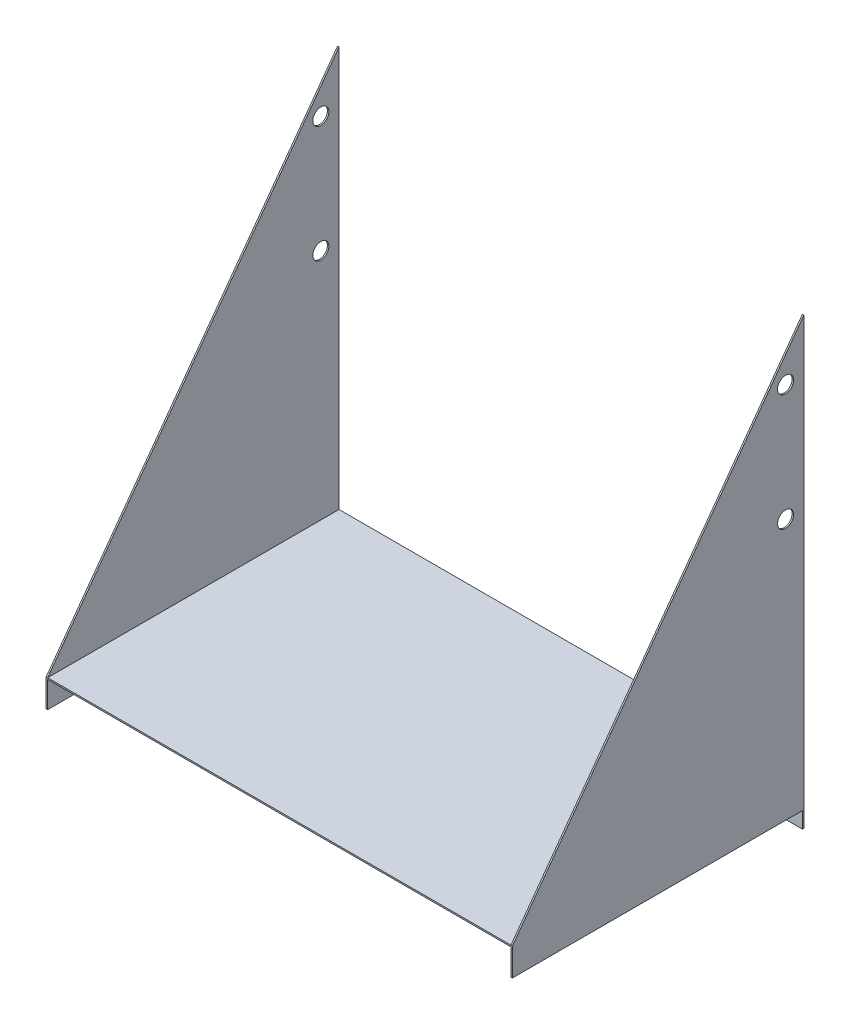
ISO-10303-21;
HEADER;
FILE_DESCRIPTION(('STEP AP214'),'2;1');
FILE_NAME('part.step','',(''),(''),'','','');
FILE_SCHEMA(('AUTOMOTIVE_DESIGN { 1 0 10303 214 1 1 1 1 }'));
ENDSEC;
DATA;
#1=APPLICATION_CONTEXT('core data for automotive mechanical design processes');
#2=APPLICATION_PROTOCOL_DEFINITION('international standard','automotive_design',2000,#1);
#3=PRODUCT_CONTEXT('',#1,'mechanical');
#4=PRODUCT('Part','Part','',(#3));
#5=PRODUCT_RELATED_PRODUCT_CATEGORY('part','',(#4));
#6=PRODUCT_DEFINITION_FORMATION('','',#4);
#7=PRODUCT_DEFINITION_CONTEXT('part definition',#1,'design');
#8=PRODUCT_DEFINITION('design','',#6,#7);
#9=PRODUCT_DEFINITION_SHAPE('','',#8);
#10=(LENGTH_UNIT() NAMED_UNIT(*) SI_UNIT(.MILLI.,.METRE.));
#11=(NAMED_UNIT(*) PLANE_ANGLE_UNIT() SI_UNIT($,.RADIAN.));
#12=(NAMED_UNIT(*) SI_UNIT($,.STERADIAN.) SOLID_ANGLE_UNIT());
#13=UNCERTAINTY_MEASURE_WITH_UNIT(LENGTH_MEASURE(1.E-05),#10,'distance_accuracy_value','');
#14=(GEOMETRIC_REPRESENTATION_CONTEXT(3) GLOBAL_UNCERTAINTY_ASSIGNED_CONTEXT((#13)) GLOBAL_UNIT_ASSIGNED_CONTEXT((#10,
#11,#12)) REPRESENTATION_CONTEXT('',''));
#15=CARTESIAN_POINT('',(0.,0.,0.));
#16=DIRECTION('',(0.,0.,1.));
#17=DIRECTION('',(1.,0.,0.));
#18=AXIS2_PLACEMENT_3D('',#15,#16,#17);
#19=CARTESIAN_POINT('',(-52.26514997,-18.,200.));
#20=DIRECTION('',(0.,-1.,0.));
#21=DIRECTION('',(0.,0.,-1.));
#22=AXIS2_PLACEMENT_3D('',#19,#20,#21);
#23=PLANE('',#22);
#24=DIRECTION('',(0.,0.,-1.));
#25=VECTOR('',#24,1.);
#26=CARTESIAN_POINT('',(-53.26514997,-18.,200.));
#27=LINE('',#26,#25);
#28=CARTESIAN_POINT('',(-53.26514997,-18.,200.));
#29=VERTEX_POINT('',#28);
#30=CARTESIAN_POINT('',(-53.26514997,-18.,1.));
#31=VERTEX_POINT('',#30);
#32=EDGE_CURVE('E11',#29,#31,#27,.T.);
#33=ORIENTED_EDGE('',*,*,#32,.T.);
#34=DIRECTION('',(1.,0.,0.));
#35=VECTOR('',#34,1.);
#36=CARTESIAN_POINT('',(-52.26514997,-18.,1.));
#37=LINE('',#36,#35);
#38=CARTESIAN_POINT('',(-52.26514997,-18.,1.));
#39=VERTEX_POINT('',#38);
#40=EDGE_CURVE('E176',#31,#39,#37,.T.);
#41=ORIENTED_EDGE('',*,*,#40,.T.);
#42=DIRECTION('',(0.,0.,-1.));
#43=VECTOR('',#42,1.);
#44=CARTESIAN_POINT('',(-52.26514997,-18.,200.));
#45=LINE('',#44,#43);
#46=CARTESIAN_POINT('',(-52.26514997,-18.,200.));
#47=VERTEX_POINT('',#46);
#48=EDGE_CURVE('E36',#47,#39,#45,.T.);
#49=ORIENTED_EDGE('',*,*,#48,.F.);
#50=DIRECTION('',(-1.,0.,0.));
#51=VECTOR('',#50,1.);
#52=CARTESIAN_POINT('',(-52.26514997,-18.,200.));
#53=LINE('',#52,#51);
#54=EDGE_CURVE('E262',#47,#29,#53,.T.);
#55=ORIENTED_EDGE('',*,*,#54,.T.);
#56=EDGE_LOOP('',(#33,#41,#49,#55));
#57=FACE_BOUND('',#56,.T.);
#58=ADVANCED_FACE('F27',(#57),#23,.T.);
#59=CARTESIAN_POINT('',(-52.26514997,0.,200.));
#60=DIRECTION('',(1.,0.,0.));
#61=DIRECTION('',(0.,0.,-1.));
#62=AXIS2_PLACEMENT_3D('',#59,#60,#61);
#63=PLANE('',#62);
#64=ORIENTED_EDGE('',*,*,#48,.T.);
#65=DIRECTION('',(0.,1.,0.));
#66=VECTOR('',#65,1.);
#67=CARTESIAN_POINT('',(-52.26514997,0.,1.));
#68=LINE('',#67,#66);
#69=CARTESIAN_POINT('',(-52.26514997,0.,1.));
#70=VERTEX_POINT('',#69);
#71=EDGE_CURVE('E173',#39,#70,#68,.T.);
#72=ORIENTED_EDGE('',*,*,#71,.T.);
#73=DIRECTION('',(0.,0.,-1.));
#74=VECTOR('',#73,1.);
#75=CARTESIAN_POINT('',(-52.26514997,0.,200.));
#76=LINE('',#75,#74);
#77=CARTESIAN_POINT('',(-52.26514997,0.,200.));
#78=VERTEX_POINT('',#77);
#79=EDGE_CURVE('E315',#78,#70,#76,.T.);
#80=ORIENTED_EDGE('',*,*,#79,.F.);
#81=DIRECTION('',(0.,-1.,0.));
#82=VECTOR('',#81,1.);
#83=CARTESIAN_POINT('',(-52.26514997,0.,200.));
#84=LINE('',#83,#82);
#85=EDGE_CURVE('E266',#78,#47,#84,.T.);
#86=ORIENTED_EDGE('',*,*,#85,.T.);
#87=EDGE_LOOP('',(#64,#72,#80,#86));
#88=FACE_BOUND('',#87,.T.);
#89=ADVANCED_FACE('F320',(#88),#63,.T.);
#90=CARTESIAN_POINT('',(-52.26514997,0.,200.));
#91=DIRECTION('',(0.,-1.,0.));
#92=DIRECTION('',(0.,0.,-1.));
#93=AXIS2_PLACEMENT_3D('',#90,#91,#92);
#94=PLANE('',#93);
#95=ORIENTED_EDGE('',*,*,#79,.T.);
#96=DIRECTION('',(1.,0.,0.));
#97=VECTOR('',#96,1.);
#98=CARTESIAN_POINT('',(266.73485003,0.,1.));
#99=LINE('',#98,#97);
#100=CARTESIAN_POINT('',(265.73485003,0.,1.));
#101=VERTEX_POINT('',#100);
#102=EDGE_CURVE('E155',#70,#101,#99,.T.);
#103=ORIENTED_EDGE('',*,*,#102,.T.);
#104=DIRECTION('',(0.,0.,-1.));
#105=VECTOR('',#104,1.);
#106=CARTESIAN_POINT('',(265.73485003,0.,200.));
#107=LINE('',#106,#105);
#108=CARTESIAN_POINT('',(265.73485003,0.,200.));
#109=VERTEX_POINT('',#108);
#110=EDGE_CURVE('E312',#109,#101,#107,.T.);
#111=ORIENTED_EDGE('',*,*,#110,.F.);
#112=DIRECTION('',(-1.,0.,0.));
#113=VECTOR('',#112,1.);
#114=CARTESIAN_POINT('',(-52.26514997,0.,200.));
#115=LINE('',#114,#113);
#116=EDGE_CURVE('E269',#109,#78,#115,.T.);
#117=ORIENTED_EDGE('',*,*,#116,.T.);
#118=EDGE_LOOP('',(#95,#103,#111,#117));
#119=FACE_BOUND('',#118,.T.);
#120=ADVANCED_FACE('F324',(#119),#94,.T.);
#121=CARTESIAN_POINT('',(265.73485003,0.,200.));
#122=DIRECTION('',(-1.,0.,0.));
#123=DIRECTION('',(0.,0.,1.));
#124=AXIS2_PLACEMENT_3D('',#121,#122,#123);
#125=PLANE('',#124);
#126=ORIENTED_EDGE('',*,*,#110,.T.);
#127=DIRECTION('',(0.,-1.,0.));
#128=VECTOR('',#127,1.);
#129=CARTESIAN_POINT('',(265.73485003,0.,1.));
#130=LINE('',#129,#128);
#131=CARTESIAN_POINT('',(265.73485003,-18.,1.));
#132=VERTEX_POINT('',#131);
#133=EDGE_CURVE('E170',#101,#132,#130,.T.);
#134=ORIENTED_EDGE('',*,*,#133,.T.);
#135=DIRECTION('',(0.,0.,-1.));
#136=VECTOR('',#135,1.);
#137=CARTESIAN_POINT('',(265.73485003,-18.,200.));
#138=LINE('',#137,#136);
#139=CARTESIAN_POINT('',(265.73485003,-18.,200.));
#140=VERTEX_POINT('',#139);
#141=EDGE_CURVE('E310',#140,#132,#138,.T.);
#142=ORIENTED_EDGE('',*,*,#141,.F.);
#143=DIRECTION('',(0.,1.,0.));
#144=VECTOR('',#143,1.);
#145=CARTESIAN_POINT('',(265.73485003,0.,200.));
#146=LINE('',#145,#144);
#147=EDGE_CURVE('E276',#140,#109,#146,.T.);
#148=ORIENTED_EDGE('',*,*,#147,.T.);
#149=EDGE_LOOP('',(#126,#134,#142,#148));
#150=FACE_BOUND('',#149,.T.);
#151=ADVANCED_FACE('F326',(#150),#125,.T.);
#152=CARTESIAN_POINT('',(266.73485003,-18.,200.));
#153=DIRECTION('',(0.,-1.,0.));
#154=DIRECTION('',(0.,0.,-1.));
#155=AXIS2_PLACEMENT_3D('',#152,#153,#154);
#156=PLANE('',#155);
#157=ORIENTED_EDGE('',*,*,#141,.T.);
#158=DIRECTION('',(1.,0.,0.));
#159=VECTOR('',#158,1.);
#160=CARTESIAN_POINT('',(266.73485003,-18.,1.));
#161=LINE('',#160,#159);
#162=CARTESIAN_POINT('',(266.73485003,-18.,1.));
#163=VERTEX_POINT('',#162);
#164=EDGE_CURVE('E166',#132,#163,#161,.T.);
#165=ORIENTED_EDGE('',*,*,#164,.T.);
#166=DIRECTION('',(0.,0.,-1.));
#167=VECTOR('',#166,1.);
#168=CARTESIAN_POINT('',(266.73485003,-18.,200.));
#169=LINE('',#168,#167);
#170=CARTESIAN_POINT('',(266.73485003,-18.,200.));
#171=VERTEX_POINT('',#170);
#172=EDGE_CURVE('E287',#171,#163,#169,.T.);
#173=ORIENTED_EDGE('',*,*,#172,.F.);
#174=DIRECTION('',(-1.,0.,0.));
#175=VECTOR('',#174,1.);
#176=CARTESIAN_POINT('',(266.73485003,-18.,200.));
#177=LINE('',#176,#175);
#178=EDGE_CURVE('E279',#171,#140,#177,.T.);
#179=ORIENTED_EDGE('',*,*,#178,.T.);
#180=EDGE_LOOP('',(#157,#165,#173,#179));
#181=FACE_BOUND('',#180,.T.);
#182=ADVANCED_FACE('F327',(#181),#156,.T.);
#183=CARTESIAN_POINT('',(-52.26514997,1.,200.));
#184=DIRECTION('',(0.,-1.,0.));
#185=DIRECTION('',(0.,0.,-1.));
#186=AXIS2_PLACEMENT_3D('',#183,#184,#185);
#187=PLANE('',#186);
#188=DIRECTION('',(0.,0.,-1.));
#189=VECTOR('',#188,1.);
#190=CARTESIAN_POINT('',(-52.26514997,1.,200.));
#191=LINE('',#190,#189);
#192=CARTESIAN_POINT('',(-52.26514997,1.,200.));
#193=VERTEX_POINT('',#192);
#194=CARTESIAN_POINT('',(-52.26514997,1.,0.));
#195=VERTEX_POINT('',#194);
#196=EDGE_CURVE('E189',#193,#195,#191,.T.);
#197=ORIENTED_EDGE('',*,*,#196,.F.);
#198=DIRECTION('',(1.,0.,0.));
#199=VECTOR('',#198,1.);
#200=CARTESIAN_POINT('',(-52.26514997,1.,200.));
#201=LINE('',#200,#199);
#202=CARTESIAN_POINT('',(265.73485003,1.,200.));
#203=VERTEX_POINT('',#202);
#204=EDGE_CURVE('E284',#203,#193,#201,.F.);
#205=ORIENTED_EDGE('',*,*,#204,.F.);
#206=DIRECTION('',(0.,0.,-1.));
#207=VECTOR('',#206,1.);
#208=CARTESIAN_POINT('',(265.73485003,1.,0.));
#209=LINE('',#208,#207);
#210=CARTESIAN_POINT('',(265.73485003,1.,0.));
#211=VERTEX_POINT('',#210);
#212=EDGE_CURVE('E194',#203,#211,#209,.T.);
#213=ORIENTED_EDGE('',*,*,#212,.T.);
#214=DIRECTION('',(1.,0.,0.));
#215=VECTOR('',#214,1.);
#216=CARTESIAN_POINT('',(-52.26514997,1.,0.));
#217=LINE('',#216,#215);
#218=EDGE_CURVE('E135',#211,#195,#217,.F.);
#219=ORIENTED_EDGE('',*,*,#218,.T.);
#220=EDGE_LOOP('',(#197,#205,#213,#219));
#221=FACE_BOUND('',#220,.T.);
#222=ADVANCED_FACE('F303',(#221),#187,.F.);
#223=CARTESIAN_POINT('',(-53.26514997,0.,200.));
#224=DIRECTION('',(1.,0.,0.));
#225=DIRECTION('',(0.,0.,-1.));
#226=AXIS2_PLACEMENT_3D('',#223,#224,#225);
#227=PLANE('',#226);
#228=CARTESIAN_POINT('',(-53.26514997,161.,12.5));
#229=DIRECTION('',(1.,0.,0.));
#230=DIRECTION('',(0.,0.,-1.));
#231=AXIS2_PLACEMENT_3D('',#228,#229,#230);
#232=CIRCLE('',#231,5.5);
#233=CARTESIAN_POINT('',(-53.26514997,161.,7.00000000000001));
#234=VERTEX_POINT('',#233);
#235=EDGE_CURVE('E218',#234,#234,#232,.T.);
#236=ORIENTED_EDGE('',*,*,#235,.T.);
#237=EDGE_LOOP('',(#236));
#238=FACE_BOUND('',#237,.T.);
#239=CARTESIAN_POINT('',(-53.26514997,241.,12.5));
#240=DIRECTION('',(1.,0.,0.));
#241=DIRECTION('',(0.,0.,-1.));
#242=AXIS2_PLACEMENT_3D('',#239,#240,#241);
#243=CIRCLE('',#242,5.5);
#244=CARTESIAN_POINT('',(-53.26514997,241.,7.));
#245=VERTEX_POINT('',#244);
#246=EDGE_CURVE('E152',#245,#245,#243,.T.);
#247=ORIENTED_EDGE('',*,*,#246,.T.);
#248=EDGE_LOOP('',(#247));
#249=FACE_BOUND('',#248,.T.);
#250=DIRECTION('',(0.,1.,0.));
#251=VECTOR('',#250,1.);
#252=CARTESIAN_POINT('',(-53.26514997,0.,0.));
#253=LINE('',#252,#251);
#254=CARTESIAN_POINT('',(-53.26514997,276.,0.));
#255=VERTEX_POINT('',#254);
#256=CARTESIAN_POINT('',(-53.26514997,-29.,0.));
#257=VERTEX_POINT('',#256);
#258=EDGE_CURVE('E136',#255,#257,#253,.F.);
#259=ORIENTED_EDGE('',*,*,#258,.T.);
#260=DIRECTION('',(0.,0.,-1.));
#261=VECTOR('',#260,1.);
#262=CARTESIAN_POINT('',(-53.26514997,-29.,1.));
#263=LINE('',#262,#261);
#264=CARTESIAN_POINT('',(-53.26514997,-29.,1.));
#265=VERTEX_POINT('',#264);
#266=EDGE_CURVE('E146',#265,#257,#263,.T.);
#267=ORIENTED_EDGE('',*,*,#266,.F.);
#268=DIRECTION('',(0.,1.,0.));
#269=VECTOR('',#268,1.);
#270=CARTESIAN_POINT('',(-53.26514997,0.,1.));
#271=LINE('',#270,#269);
#272=EDGE_CURVE('E151',#265,#31,#271,.T.);
#273=ORIENTED_EDGE('',*,*,#272,.T.);
#274=ORIENTED_EDGE('',*,*,#32,.F.);
#275=DIRECTION('',(0.,1.,0.));
#276=VECTOR('',#275,1.);
#277=CARTESIAN_POINT('',(-53.26514997,0.,200.));
#278=LINE('',#277,#276);
#279=CARTESIAN_POINT('',(-53.26514997,1.,200.));
#280=VERTEX_POINT('',#279);
#281=EDGE_CURVE('E267',#280,#29,#278,.F.);
#282=ORIENTED_EDGE('',*,*,#281,.F.);
#283=DIRECTION('',(0.,0.808736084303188,-0.588171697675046));
#284=VECTOR('',#283,1.);
#285=CARTESIAN_POINT('',(-53.26514997,276.,0.));
#286=LINE('',#285,#284);
#287=EDGE_CURVE('E52',#280,#255,#286,.T.);
#288=ORIENTED_EDGE('',*,*,#287,.T.);
#289=EDGE_LOOP('',(#259,#267,#273,#274,#282,#288));
#290=FACE_BOUND('',#289,.T.);
#291=ADVANCED_FACE('F29',(#238,#249,#290),#227,.F.);
#292=CARTESIAN_POINT('',(266.73485003,0.,200.));
#293=DIRECTION('',(-1.,0.,0.));
#294=DIRECTION('',(0.,0.,1.));
#295=AXIS2_PLACEMENT_3D('',#292,#293,#294);
#296=PLANE('',#295);
#297=CARTESIAN_POINT('',(266.73485003,161.,12.5));
#298=DIRECTION('',(1.,0.,0.));
#299=DIRECTION('',(0.,0.,-1.));
#300=AXIS2_PLACEMENT_3D('',#297,#298,#299);
#301=CIRCLE('',#300,5.5);
#302=CARTESIAN_POINT('',(266.73485003,161.,7.00000000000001));
#303=VERTEX_POINT('',#302);
#304=EDGE_CURVE('E228',#303,#303,#301,.T.);
#305=ORIENTED_EDGE('',*,*,#304,.F.);
#306=EDGE_LOOP('',(#305));
#307=FACE_BOUND('',#306,.T.);
#308=CARTESIAN_POINT('',(266.73485003,241.,12.5));
#309=DIRECTION('',(1.,0.,0.));
#310=DIRECTION('',(0.,0.,-1.));
#311=AXIS2_PLACEMENT_3D('',#308,#309,#310);
#312=CIRCLE('',#311,5.5);
#313=CARTESIAN_POINT('',(266.73485003,241.,7.));
#314=VERTEX_POINT('',#313);
#315=EDGE_CURVE('E213',#314,#314,#312,.T.);
#316=ORIENTED_EDGE('',*,*,#315,.F.);
#317=EDGE_LOOP('',(#316));
#318=FACE_BOUND('',#317,.T.);
#319=DIRECTION('',(0.,1.,0.));
#320=VECTOR('',#319,1.);
#321=CARTESIAN_POINT('',(266.73485003,0.,0.));
#322=LINE('',#321,#320);
#323=CARTESIAN_POINT('',(266.73485003,-29.,0.));
#324=VERTEX_POINT('',#323);
#325=CARTESIAN_POINT('',(266.73485003,276.,0.));
#326=VERTEX_POINT('',#325);
#327=EDGE_CURVE('E126',#324,#326,#322,.T.);
#328=ORIENTED_EDGE('',*,*,#327,.T.);
#329=DIRECTION('',(0.,-0.808736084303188,0.588171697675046));
#330=VECTOR('',#329,1.);
#331=CARTESIAN_POINT('',(266.73485003,276.,0.));
#332=LINE('',#331,#330);
#333=CARTESIAN_POINT('',(266.73485003,1.,200.));
#334=VERTEX_POINT('',#333);
#335=EDGE_CURVE('E192',#326,#334,#332,.T.);
#336=ORIENTED_EDGE('',*,*,#335,.T.);
#337=DIRECTION('',(0.,1.,0.));
#338=VECTOR('',#337,1.);
#339=CARTESIAN_POINT('',(266.73485003,0.,200.));
#340=LINE('',#339,#338);
#341=EDGE_CURVE('E282',#171,#334,#340,.T.);
#342=ORIENTED_EDGE('',*,*,#341,.F.);
#343=ORIENTED_EDGE('',*,*,#172,.T.);
#344=DIRECTION('',(0.,-1.,0.));
#345=VECTOR('',#344,1.);
#346=CARTESIAN_POINT('',(266.73485003,0.,1.));
#347=LINE('',#346,#345);
#348=CARTESIAN_POINT('',(266.73485003,-29.,1.));
#349=VERTEX_POINT('',#348);
#350=EDGE_CURVE('E142',#163,#349,#347,.T.);
#351=ORIENTED_EDGE('',*,*,#350,.T.);
#352=DIRECTION('',(0.,0.,-1.));
#353=VECTOR('',#352,1.);
#354=CARTESIAN_POINT('',(266.73485003,-29.,1.));
#355=LINE('',#354,#353);
#356=EDGE_CURVE('E139',#349,#324,#355,.T.);
#357=ORIENTED_EDGE('',*,*,#356,.T.);
#358=EDGE_LOOP('',(#328,#336,#342,#343,#351,#357));
#359=FACE_BOUND('',#358,.T.);
#360=ADVANCED_FACE('F140',(#307,#318,#359),#296,.F.);
#361=CARTESIAN_POINT('',(-53.26514997,-18.,200.));
#362=DIRECTION('',(0.,0.,1.));
#363=DIRECTION('',(1.,0.,0.));
#364=AXIS2_PLACEMENT_3D('',#361,#362,#363);
#365=PLANE('',#364);
#366=ORIENTED_EDGE('',*,*,#85,.F.);
#367=ORIENTED_EDGE('',*,*,#116,.F.);
#368=ORIENTED_EDGE('',*,*,#147,.F.);
#369=ORIENTED_EDGE('',*,*,#178,.F.);
#370=ORIENTED_EDGE('',*,*,#341,.T.);
#371=EDGE_CURVE('E201',#334,#203,#201,.F.);
#372=ORIENTED_EDGE('',*,*,#371,.T.);
#373=ORIENTED_EDGE('',*,*,#204,.T.);
#374=DIRECTION('',(-1.,0.,0.));
#375=VECTOR('',#374,1.);
#376=CARTESIAN_POINT('',(-52.26514997,1.,200.));
#377=LINE('',#376,#375);
#378=EDGE_CURVE('E186',#193,#280,#377,.T.);
#379=ORIENTED_EDGE('',*,*,#378,.T.);
#380=ORIENTED_EDGE('',*,*,#281,.T.);
#381=ORIENTED_EDGE('',*,*,#54,.F.);
#382=EDGE_LOOP('',(#366,#367,#368,#369,#370,#372,#373,#379,#380,#381));
#383=FACE_BOUND('',#382,.T.);
#384=ADVANCED_FACE('F306',(#383),#365,.T.);
#385=CARTESIAN_POINT('',(-53.26514997,-18.,0.));
#386=DIRECTION('',(0.,0.,1.));
#387=DIRECTION('',(1.,0.,0.));
#388=AXIS2_PLACEMENT_3D('',#385,#386,#387);
#389=PLANE('',#388);
#390=CARTESIAN_POINT('',(246.73485003,-9.00000000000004,0.));
#391=DIRECTION('',(0.,0.,1.));
#392=DIRECTION('',(1.,0.,0.));
#393=AXIS2_PLACEMENT_3D('',#390,#391,#392);
#394=CIRCLE('',#393,5.50000000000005);
#395=CARTESIAN_POINT('',(252.23485003,-9.00000000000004,0.));
#396=VERTEX_POINT('',#395);
#397=EDGE_CURVE('E237',#396,#396,#394,.T.);
#398=ORIENTED_EDGE('',*,*,#397,.T.);
#399=EDGE_LOOP('',(#398));
#400=FACE_BOUND('',#399,.T.);
#401=CARTESIAN_POINT('',(-33.26514997,-9.00000000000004,0.));
#402=DIRECTION('',(0.,0.,1.));
#403=DIRECTION('',(1.,0.,0.));
#404=AXIS2_PLACEMENT_3D('',#401,#402,#403);
#405=CIRCLE('',#404,5.5);
#406=CARTESIAN_POINT('',(-27.76514997,-9.00000000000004,0.));
#407=VERTEX_POINT('',#406);
#408=EDGE_CURVE('E231',#407,#407,#405,.T.);
#409=ORIENTED_EDGE('',*,*,#408,.T.);
#410=EDGE_LOOP('',(#409));
#411=FACE_BOUND('',#410,.T.);
#412=DIRECTION('',(-1.,0.,0.));
#413=VECTOR('',#412,1.);
#414=CARTESIAN_POINT('',(-53.26514997,-29.,0.));
#415=LINE('',#414,#413);
#416=EDGE_CURVE('E130',#324,#257,#415,.T.);
#417=ORIENTED_EDGE('',*,*,#416,.T.);
#418=ORIENTED_EDGE('',*,*,#258,.F.);
#419=DIRECTION('',(-1.,0.,0.));
#420=VECTOR('',#419,1.);
#421=CARTESIAN_POINT('',(-52.26514997,276.,0.));
#422=LINE('',#421,#420);
#423=CARTESIAN_POINT('',(-52.26514997,276.,0.));
#424=VERTEX_POINT('',#423);
#425=EDGE_CURVE('E187',#424,#255,#422,.T.);
#426=ORIENTED_EDGE('',*,*,#425,.F.);
#427=DIRECTION('',(0.,-1.,0.));
#428=VECTOR('',#427,1.);
#429=CARTESIAN_POINT('',(-52.26514997,1.,0.));
#430=LINE('',#429,#428);
#431=EDGE_CURVE('E180',#424,#195,#430,.T.);
#432=ORIENTED_EDGE('',*,*,#431,.T.);
#433=ORIENTED_EDGE('',*,*,#218,.F.);
#434=DIRECTION('',(0.,1.,0.));
#435=VECTOR('',#434,1.);
#436=CARTESIAN_POINT('',(265.73485003,1.,0.));
#437=LINE('',#436,#435);
#438=CARTESIAN_POINT('',(265.73485003,276.,0.));
#439=VERTEX_POINT('',#438);
#440=EDGE_CURVE('E44',#211,#439,#437,.T.);
#441=ORIENTED_EDGE('',*,*,#440,.T.);
#442=DIRECTION('',(1.,0.,0.));
#443=VECTOR('',#442,1.);
#444=CARTESIAN_POINT('',(265.73485003,276.,0.));
#445=LINE('',#444,#443);
#446=EDGE_CURVE('E131',#439,#326,#445,.T.);
#447=ORIENTED_EDGE('',*,*,#446,.T.);
#448=ORIENTED_EDGE('',*,*,#327,.F.);
#449=EDGE_LOOP('',(#417,#418,#426,#432,#433,#441,#447,#448));
#450=FACE_BOUND('',#449,.T.);
#451=ADVANCED_FACE('F128',(#400,#411,#450),#389,.F.);
#452=CARTESIAN_POINT('',(265.73485003,276.,0.));
#453=DIRECTION('',(0.,0.588171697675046,0.808736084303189));
#454=DIRECTION('',(0.,-0.808736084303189,0.588171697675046));
#455=AXIS2_PLACEMENT_3D('',#452,#453,#454);
#456=PLANE('',#455);
#457=ORIENTED_EDGE('',*,*,#335,.F.);
#458=ORIENTED_EDGE('',*,*,#446,.F.);
#459=DIRECTION('',(0.,-0.808736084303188,0.588171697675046));
#460=VECTOR('',#459,1.);
#461=CARTESIAN_POINT('',(265.73485003,276.,0.));
#462=LINE('',#461,#460);
#463=EDGE_CURVE('E205',#439,#203,#462,.T.);
#464=ORIENTED_EDGE('',*,*,#463,.T.);
#465=ORIENTED_EDGE('',*,*,#371,.F.);
#466=EDGE_LOOP('',(#457,#458,#464,#465));
#467=FACE_BOUND('',#466,.T.);
#468=ADVANCED_FACE('F328',(#467),#456,.T.);
#469=CARTESIAN_POINT('',(265.73485003,1.,0.));
#470=DIRECTION('',(-1.,0.,0.));
#471=DIRECTION('',(0.,0.,1.));
#472=AXIS2_PLACEMENT_3D('',#469,#470,#471);
#473=PLANE('',#472);
#474=CARTESIAN_POINT('',(265.73485003,161.,12.5));
#475=DIRECTION('',(-1.,0.,0.));
#476=DIRECTION('',(0.,0.,1.));
#477=AXIS2_PLACEMENT_3D('',#474,#475,#476);
#478=CIRCLE('',#477,5.5);
#479=CARTESIAN_POINT('',(265.73485003,161.,18.));
#480=VERTEX_POINT('',#479);
#481=EDGE_CURVE('E223',#480,#480,#478,.T.);
#482=ORIENTED_EDGE('',*,*,#481,.F.);
#483=EDGE_LOOP('',(#482));
#484=FACE_BOUND('',#483,.T.);
#485=CARTESIAN_POINT('',(265.73485003,241.,12.5));
#486=DIRECTION('',(-1.,0.,0.));
#487=DIRECTION('',(0.,0.,1.));
#488=AXIS2_PLACEMENT_3D('',#485,#486,#487);
#489=CIRCLE('',#488,5.5);
#490=CARTESIAN_POINT('',(265.73485003,241.,18.));
#491=VERTEX_POINT('',#490);
#492=EDGE_CURVE('E158',#491,#491,#489,.T.);
#493=ORIENTED_EDGE('',*,*,#492,.F.);
#494=EDGE_LOOP('',(#493));
#495=FACE_BOUND('',#494,.T.);
#496=ORIENTED_EDGE('',*,*,#212,.F.);
#497=ORIENTED_EDGE('',*,*,#463,.F.);
#498=ORIENTED_EDGE('',*,*,#440,.F.);
#499=EDGE_LOOP('',(#496,#497,#498));
#500=FACE_BOUND('',#499,.T.);
#501=ADVANCED_FACE('F329',(#484,#495,#500),#473,.T.);
#502=CARTESIAN_POINT('',(-52.26514997,-18.,0.));
#503=DIRECTION('',(-1.,0.,0.));
#504=DIRECTION('',(0.,0.,1.));
#505=AXIS2_PLACEMENT_3D('',#502,#503,#504);
#506=PLANE('',#505);
#507=CARTESIAN_POINT('',(-52.26514997,161.,12.5));
#508=DIRECTION('',(-1.,0.,0.));
#509=DIRECTION('',(0.,0.,1.));
#510=AXIS2_PLACEMENT_3D('',#507,#508,#509);
#511=CIRCLE('',#510,5.5);
#512=CARTESIAN_POINT('',(-52.26514997,161.,18.));
#513=VERTEX_POINT('',#512);
#514=EDGE_CURVE('E31',#513,#513,#511,.T.);
#515=ORIENTED_EDGE('',*,*,#514,.T.);
#516=EDGE_LOOP('',(#515));
#517=FACE_BOUND('',#516,.T.);
#518=CARTESIAN_POINT('',(-52.26514997,241.,12.5));
#519=DIRECTION('',(-1.,0.,0.));
#520=DIRECTION('',(0.,0.,1.));
#521=AXIS2_PLACEMENT_3D('',#518,#519,#520);
#522=CIRCLE('',#521,5.5);
#523=CARTESIAN_POINT('',(-52.26514997,241.,18.));
#524=VERTEX_POINT('',#523);
#525=EDGE_CURVE('E211',#524,#524,#522,.T.);
#526=ORIENTED_EDGE('',*,*,#525,.T.);
#527=EDGE_LOOP('',(#526));
#528=FACE_BOUND('',#527,.T.);
#529=DIRECTION('',(0.,0.808736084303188,-0.588171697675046));
#530=VECTOR('',#529,1.);
#531=CARTESIAN_POINT('',(-52.26514997,276.,0.));
#532=LINE('',#531,#530);
#533=EDGE_CURVE('E183',#193,#424,#532,.T.);
#534=ORIENTED_EDGE('',*,*,#533,.F.);
#535=ORIENTED_EDGE('',*,*,#196,.T.);
#536=ORIENTED_EDGE('',*,*,#431,.F.);
#537=EDGE_LOOP('',(#534,#535,#536));
#538=FACE_BOUND('',#537,.T.);
#539=ADVANCED_FACE('F300',(#517,#528,#538),#506,.F.);
#540=CARTESIAN_POINT('',(-52.26514997,276.,0.));
#541=DIRECTION('',(0.,0.588171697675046,0.808736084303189));
#542=DIRECTION('',(0.,-0.808736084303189,0.588171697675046));
#543=AXIS2_PLACEMENT_3D('',#540,#541,#542);
#544=PLANE('',#543);
#545=ORIENTED_EDGE('',*,*,#287,.F.);
#546=ORIENTED_EDGE('',*,*,#378,.F.);
#547=ORIENTED_EDGE('',*,*,#533,.T.);
#548=ORIENTED_EDGE('',*,*,#425,.T.);
#549=EDGE_LOOP('',(#545,#546,#547,#548));
#550=FACE_BOUND('',#549,.T.);
#551=ADVANCED_FACE('F296',(#550),#544,.T.);
#552=CARTESIAN_POINT('',(-53.26514997,-29.,1.));
#553=DIRECTION('',(0.,-1.,0.));
#554=DIRECTION('',(1.,0.,0.));
#555=AXIS2_PLACEMENT_3D('',#552,#553,#554);
#556=PLANE('',#555);
#557=ORIENTED_EDGE('',*,*,#416,.F.);
#558=ORIENTED_EDGE('',*,*,#356,.F.);
#559=DIRECTION('',(-1.,0.,0.));
#560=VECTOR('',#559,1.);
#561=CARTESIAN_POINT('',(-53.26514997,-29.,1.));
#562=LINE('',#561,#560);
#563=EDGE_CURVE('E147',#349,#265,#562,.T.);
#564=ORIENTED_EDGE('',*,*,#563,.T.);
#565=ORIENTED_EDGE('',*,*,#266,.T.);
#566=EDGE_LOOP('',(#557,#558,#564,#565));
#567=FACE_BOUND('',#566,.T.);
#568=ADVANCED_FACE('F150',(#567),#556,.T.);
#569=CARTESIAN_POINT('',(-53.26514997,0.,1.));
#570=DIRECTION('',(0.,0.,-1.));
#571=DIRECTION('',(-1.,0.,0.));
#572=AXIS2_PLACEMENT_3D('',#569,#570,#571);
#573=PLANE('',#572);
#574=CARTESIAN_POINT('',(246.73485003,-9.00000000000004,1.));
#575=DIRECTION('',(0.,0.,1.));
#576=DIRECTION('',(1.,0.,0.));
#577=AXIS2_PLACEMENT_3D('',#574,#575,#576);
#578=CIRCLE('',#577,5.50000000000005);
#579=CARTESIAN_POINT('',(252.23485003,-9.00000000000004,1.));
#580=VERTEX_POINT('',#579);
#581=EDGE_CURVE('E240',#580,#580,#578,.T.);
#582=ORIENTED_EDGE('',*,*,#581,.F.);
#583=EDGE_LOOP('',(#582));
#584=FACE_BOUND('',#583,.T.);
#585=CARTESIAN_POINT('',(-33.26514997,-9.00000000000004,1.));
#586=DIRECTION('',(0.,0.,1.));
#587=DIRECTION('',(1.,0.,0.));
#588=AXIS2_PLACEMENT_3D('',#585,#586,#587);
#589=CIRCLE('',#588,5.5);
#590=CARTESIAN_POINT('',(-27.76514997,-9.00000000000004,1.));
#591=VERTEX_POINT('',#590);
#592=EDGE_CURVE('E234',#591,#591,#589,.T.);
#593=ORIENTED_EDGE('',*,*,#592,.F.);
#594=EDGE_LOOP('',(#593));
#595=FACE_BOUND('',#594,.T.);
#596=ORIENTED_EDGE('',*,*,#40,.F.);
#597=ORIENTED_EDGE('',*,*,#272,.F.);
#598=ORIENTED_EDGE('',*,*,#563,.F.);
#599=ORIENTED_EDGE('',*,*,#350,.F.);
#600=ORIENTED_EDGE('',*,*,#164,.F.);
#601=ORIENTED_EDGE('',*,*,#133,.F.);
#602=ORIENTED_EDGE('',*,*,#102,.F.);
#603=ORIENTED_EDGE('',*,*,#71,.F.);
#604=EDGE_LOOP('',(#596,#597,#598,#599,#600,#601,#602,#603));
#605=FACE_BOUND('',#604,.T.);
#606=ADVANCED_FACE('F247',(#584,#595,#605),#573,.F.);
#607=CARTESIAN_POINT('',(-134.26514997,241.,12.5));
#608=DIRECTION('',(1.,0.,0.));
#609=DIRECTION('',(0.,0.,-1.));
#610=AXIS2_PLACEMENT_3D('',#607,#608,#609);
#611=CYLINDRICAL_SURFACE('',#610,5.5);
#612=ORIENTED_EDGE('',*,*,#525,.F.);
#613=EDGE_LOOP('',(#612));
#614=FACE_BOUND('',#613,.T.);
#615=ORIENTED_EDGE('',*,*,#246,.F.);
#616=EDGE_LOOP('',(#615));
#617=FACE_BOUND('',#616,.T.);
#618=ADVANCED_FACE('F250',(#614,#617),#611,.F.);
#619=ORIENTED_EDGE('',*,*,#492,.T.);
#620=EDGE_LOOP('',(#619));
#621=FACE_BOUND('',#620,.T.);
#622=ORIENTED_EDGE('',*,*,#315,.T.);
#623=EDGE_LOOP('',(#622));
#624=FACE_BOUND('',#623,.T.);
#625=ADVANCED_FACE('F385',(#621,#624),#611,.F.);
#626=CARTESIAN_POINT('',(-134.26514997,161.,12.5));
#627=DIRECTION('',(1.,0.,0.));
#628=DIRECTION('',(0.,0.,-1.));
#629=AXIS2_PLACEMENT_3D('',#626,#627,#628);
#630=CYLINDRICAL_SURFACE('',#629,5.5);
#631=ORIENTED_EDGE('',*,*,#514,.F.);
#632=EDGE_LOOP('',(#631));
#633=FACE_BOUND('',#632,.T.);
#634=ORIENTED_EDGE('',*,*,#235,.F.);
#635=EDGE_LOOP('',(#634));
#636=FACE_BOUND('',#635,.T.);
#637=ADVANCED_FACE('F381',(#633,#636),#630,.F.);
#638=ORIENTED_EDGE('',*,*,#481,.T.);
#639=EDGE_LOOP('',(#638));
#640=FACE_BOUND('',#639,.T.);
#641=ORIENTED_EDGE('',*,*,#304,.T.);
#642=EDGE_LOOP('',(#641));
#643=FACE_BOUND('',#642,.T.);
#644=ADVANCED_FACE('F374',(#640,#643),#630,.F.);
#645=CARTESIAN_POINT('',(-33.26514997,-9.00000000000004,-400.));
#646=DIRECTION('',(0.,0.,1.));
#647=DIRECTION('',(1.,0.,0.));
#648=AXIS2_PLACEMENT_3D('',#645,#646,#647);
#649=CYLINDRICAL_SURFACE('',#648,5.5);
#650=ORIENTED_EDGE('',*,*,#592,.T.);
#651=EDGE_LOOP('',(#650));
#652=FACE_BOUND('',#651,.T.);
#653=ORIENTED_EDGE('',*,*,#408,.F.);
#654=EDGE_LOOP('',(#653));
#655=FACE_BOUND('',#654,.T.);
#656=ADVANCED_FACE('F372',(#652,#655),#649,.F.);
#657=CARTESIAN_POINT('',(246.73485003,-9.00000000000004,-400.));
#658=DIRECTION('',(0.,0.,1.));
#659=DIRECTION('',(1.,0.,0.));
#660=AXIS2_PLACEMENT_3D('',#657,#658,#659);
#661=CYLINDRICAL_SURFACE('',#660,5.50000000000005);
#662=ORIENTED_EDGE('',*,*,#581,.T.);
#663=EDGE_LOOP('',(#662));
#664=FACE_BOUND('',#663,.T.);
#665=ORIENTED_EDGE('',*,*,#397,.F.);
#666=EDGE_LOOP('',(#665));
#667=FACE_BOUND('',#666,.T.);
#668=ADVANCED_FACE('F244',(#664,#667),#661,.F.);
#669=CLOSED_SHELL('',(#58,#89,#120,#151,#182,#222,#291,#360,#384,#451,#468,#501,#539,#551,#568,
#606,#618,#625,#637,#644,#656,#668));
#670=MANIFOLD_SOLID_BREP('B2',#669);
#671=ADVANCED_BREP_SHAPE_REPRESENTATION('',(#18,#670),#14);
#672=SHAPE_DEFINITION_REPRESENTATION(#9,#671);
ENDSEC;
END-ISO-10303-21;
